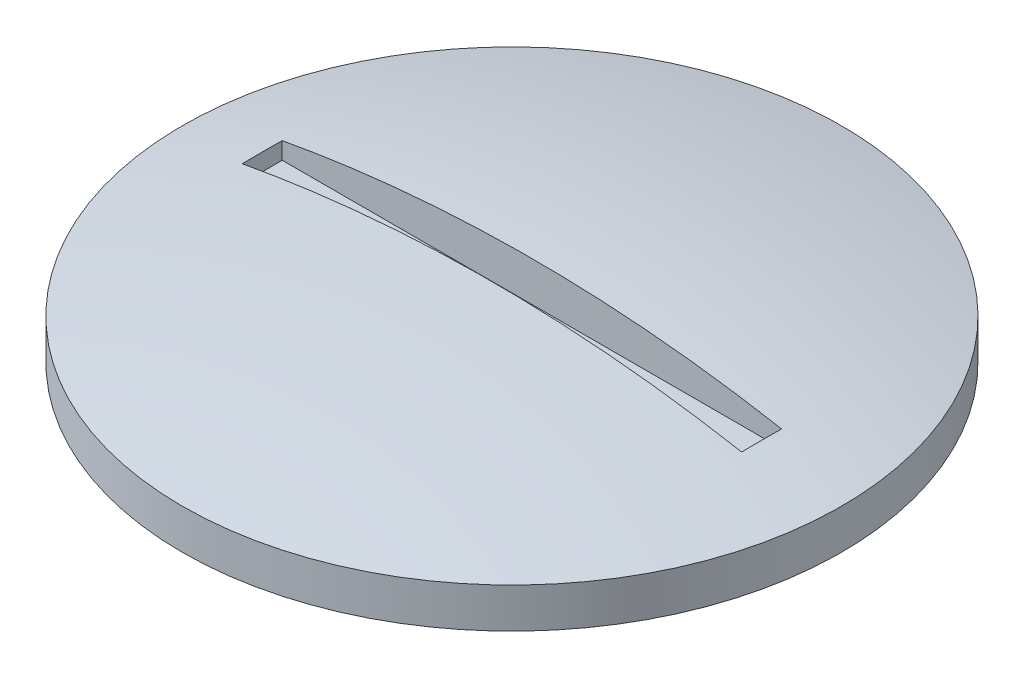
ISO-10303-21;
HEADER;
FILE_DESCRIPTION(('STEP AP214'),'2;1');
FILE_NAME('part.step','',(''),(''),'','','');
FILE_SCHEMA(('AUTOMOTIVE_DESIGN { 1 0 10303 214 1 1 1 1 }'));
ENDSEC;
DATA;
#1=APPLICATION_CONTEXT('core data for automotive mechanical design processes');
#2=APPLICATION_PROTOCOL_DEFINITION('international standard','automotive_design',2000,#1);
#3=PRODUCT_CONTEXT('',#1,'mechanical');
#4=PRODUCT('Part','Part','',(#3));
#5=PRODUCT_RELATED_PRODUCT_CATEGORY('part','',(#4));
#6=PRODUCT_DEFINITION_FORMATION('','',#4);
#7=PRODUCT_DEFINITION_CONTEXT('part definition',#1,'design');
#8=PRODUCT_DEFINITION('design','',#6,#7);
#9=PRODUCT_DEFINITION_SHAPE('','',#8);
#10=(LENGTH_UNIT() NAMED_UNIT(*) SI_UNIT(.MILLI.,.METRE.));
#11=(NAMED_UNIT(*) PLANE_ANGLE_UNIT() SI_UNIT($,.RADIAN.));
#12=(NAMED_UNIT(*) SI_UNIT($,.STERADIAN.) SOLID_ANGLE_UNIT());
#13=UNCERTAINTY_MEASURE_WITH_UNIT(LENGTH_MEASURE(1.E-05),#10,'distance_accuracy_value','');
#14=(GEOMETRIC_REPRESENTATION_CONTEXT(3) GLOBAL_UNCERTAINTY_ASSIGNED_CONTEXT((#13)) GLOBAL_UNIT_ASSIGNED_CONTEXT((#10,
#11,#12)) REPRESENTATION_CONTEXT('',''));
#15=CARTESIAN_POINT('',(0.,0.,0.));
#16=DIRECTION('',(0.,0.,1.));
#17=DIRECTION('',(1.,0.,0.));
#18=AXIS2_PLACEMENT_3D('',#15,#16,#17);
#19=CARTESIAN_POINT('',(420.25,32.,123.));
#20=DIRECTION('',(0.,-1.,0.));
#21=DIRECTION('',(0.,0.,-1.));
#22=AXIS2_PLACEMENT_3D('',#19,#20,#21);
#23=PLANE('',#22);
#24=CARTESIAN_POINT('',(412.,32.,123.));
#25=DIRECTION('',(0.,1.,0.));
#26=DIRECTION('',(0.,0.,1.));
#27=AXIS2_PLACEMENT_3D('',#24,#25,#26);
#28=CIRCLE('',#27,16.5);
#29=CARTESIAN_POINT('',(412.,32.,139.5));
#30=VERTEX_POINT('',#29);
#31=EDGE_CURVE('E67',#30,#30,#28,.T.);
#32=ORIENTED_EDGE('',*,*,#31,.F.);
#33=EDGE_LOOP('',(#32));
#34=FACE_BOUND('',#33,.T.);
#35=ADVANCED_FACE('F16',(#34),#23,.T.);
#36=CARTESIAN_POINT('',(412.,32.,123.));
#37=DIRECTION('',(0.,1.,0.));
#38=DIRECTION('',(0.,0.,1.));
#39=AXIS2_PLACEMENT_3D('',#36,#37,#38);
#40=CYLINDRICAL_SURFACE('',#39,16.5);
#41=ORIENTED_EDGE('',*,*,#31,.T.);
#42=EDGE_LOOP('',(#41));
#43=FACE_BOUND('',#42,.T.);
#44=CARTESIAN_POINT('',(412.,33.9999999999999,123.));
#45=DIRECTION('',(0.,1.,0.));
#46=DIRECTION('',(0.,0.,1.));
#47=AXIS2_PLACEMENT_3D('',#44,#45,#46);
#48=CIRCLE('',#47,16.5);
#49=CARTESIAN_POINT('',(412.,33.9999999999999,139.5));
#50=VERTEX_POINT('',#49);
#51=EDGE_CURVE('E66',#50,#50,#48,.T.);
#52=ORIENTED_EDGE('',*,*,#51,.F.);
#53=EDGE_LOOP('',(#52));
#54=FACE_BOUND('',#53,.T.);
#55=ADVANCED_FACE('F137',(#43,#54),#40,.T.);
#56=CARTESIAN_POINT('',(412.,36.,124.));
#57=DIRECTION('',(0.,0.,-1.));
#58=DIRECTION('',(-1.,0.,0.));
#59=AXIS2_PLACEMENT_3D('',#56,#57,#58);
#60=PLANE('',#59);
#61=DIRECTION('',(1.,0.,0.));
#62=VECTOR('',#61,1.);
#63=CARTESIAN_POINT('',(412.,34.,124.));
#64=LINE('',#63,#62);
#65=CARTESIAN_POINT('',(399.5,34.,124.));
#66=VERTEX_POINT('',#65);
#67=CARTESIAN_POINT('',(424.5,34.,124.));
#68=VERTEX_POINT('',#67);
#69=EDGE_CURVE('E75',#66,#68,#64,.T.);
#70=ORIENTED_EDGE('',*,*,#69,.F.);
#71=DIRECTION('',(0.,1.,0.));
#72=VECTOR('',#71,1.);
#73=CARTESIAN_POINT('',(399.5,36.,124.));
#74=LINE('',#73,#72);
#75=CARTESIAN_POINT('',(399.5,34.8519970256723,124.));
#76=VERTEX_POINT('',#75);
#77=EDGE_CURVE('E63',#76,#66,#74,.F.);
#78=ORIENTED_EDGE('',*,*,#77,.F.);
#79=CARTESIAN_POINT('',(424.5,34.8519970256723,124.));
#80=CARTESIAN_POINT('',(423.807458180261,34.979466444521,124.));
#81=CARTESIAN_POINT('',(423.112965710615,35.0963357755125,124.));
#82=CARTESIAN_POINT('',(421.72391657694,35.3082946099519,124.));
#83=CARTESIAN_POINT('',(421.029374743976,35.4034813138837,124.));
#84=CARTESIAN_POINT('',(419.64025550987,35.5723540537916,124.));
#85=CARTESIAN_POINT('',(418.945687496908,35.6461173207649,124.));
#86=CARTESIAN_POINT('',(417.556538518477,35.7723666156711,124.));
#87=CARTESIAN_POINT('',(416.861962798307,35.8249103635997,124.));
#88=CARTESIAN_POINT('',(415.472814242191,35.9088837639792,124.));
#89=CARTESIAN_POINT('',(414.778243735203,35.940351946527,124.));
#90=CARTESIAN_POINT('',(413.389115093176,35.9822802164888,124.));
#91=CARTESIAN_POINT('',(412.694557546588,35.9927598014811,124.));
#92=CARTESIAN_POINT('',(411.305442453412,35.9927598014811,124.));
#93=CARTESIAN_POINT('',(410.610884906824,35.9822802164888,124.));
#94=CARTESIAN_POINT('',(409.221756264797,35.940351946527,124.));
#95=CARTESIAN_POINT('',(408.527185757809,35.9088837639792,124.));
#96=CARTESIAN_POINT('',(407.138037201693,35.8249103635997,124.));
#97=CARTESIAN_POINT('',(406.443461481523,35.7723666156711,124.));
#98=CARTESIAN_POINT('',(405.054312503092,35.6461173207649,124.));
#99=CARTESIAN_POINT('',(404.35974449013,35.5723540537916,124.));
#100=CARTESIAN_POINT('',(402.970625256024,35.4034813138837,124.));
#101=CARTESIAN_POINT('',(402.27608342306,35.3082946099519,124.));
#102=CARTESIAN_POINT('',(400.887034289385,35.0963357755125,124.));
#103=CARTESIAN_POINT('',(400.192541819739,34.979466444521,124.));
#104=CARTESIAN_POINT('',(399.5,34.8519970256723,124.));
#105=B_SPLINE_CURVE_WITH_KNOTS('',3,(#79,#80,#81,#82,#83,#84,#85,#86,#87,#88,#89,#90,#91,#92,
#93,#94,#95,#96,#97,#98,#99,#100,#101,#102,#103,#104),.UNSPECIFIED.,.F.,.F.,(4,2,2,2,2,2,2,2,2,
2,2,2,4),(0.,2.11244228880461,4.21521975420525,6.31031989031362,8.39968204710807,
10.4852139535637,12.5688075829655,14.6524012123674,16.7379331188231,18.8272952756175,
20.9223954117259,23.0251728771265,25.1376151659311),.UNSPECIFIED.);
#106=CARTESIAN_POINT('',(424.5,34.8519970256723,124.));
#107=VERTEX_POINT('',#106);
#108=EDGE_CURVE('E57',#107,#76,#105,.T.);
#109=ORIENTED_EDGE('',*,*,#108,.F.);
#110=DIRECTION('',(0.,1.,0.));
#111=VECTOR('',#110,1.);
#112=CARTESIAN_POINT('',(424.5,36.,124.));
#113=LINE('',#112,#111);
#114=EDGE_CURVE('E62',#68,#107,#113,.T.);
#115=ORIENTED_EDGE('',*,*,#114,.F.);
#116=EDGE_LOOP('',(#70,#78,#109,#115));
#117=FACE_BOUND('',#116,.T.);
#118=ADVANCED_FACE('F60',(#117),#60,.T.);
#119=CARTESIAN_POINT('',(412.,-33.0625000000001,123.));
#120=DIRECTION('',(1.,0.,0.));
#121=DIRECTION('',(0.,1.,0.));
#122=AXIS2_PLACEMENT_3D('',#119,#120,#121);
#123=SPHERICAL_SURFACE('',#122,69.0625000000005);
#124=ORIENTED_EDGE('',*,*,#51,.T.);
#125=EDGE_LOOP('',(#124));
#126=FACE_BOUND('',#125,.T.);
#127=CARTESIAN_POINT('',(424.5,34.8519970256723,122.));
#128=CARTESIAN_POINT('',(423.807458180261,34.979466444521,122.));
#129=CARTESIAN_POINT('',(423.112965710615,35.0963357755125,122.));
#130=CARTESIAN_POINT('',(421.72391657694,35.3082946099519,122.));
#131=CARTESIAN_POINT('',(421.029374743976,35.4034813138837,122.));
#132=CARTESIAN_POINT('',(419.64025550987,35.5723540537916,122.));
#133=CARTESIAN_POINT('',(418.945687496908,35.646117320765,122.));
#134=CARTESIAN_POINT('',(417.556538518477,35.7723666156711,122.));
#135=CARTESIAN_POINT('',(416.861962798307,35.8249103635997,122.));
#136=CARTESIAN_POINT('',(415.472814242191,35.9088837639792,122.));
#137=CARTESIAN_POINT('',(414.778243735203,35.940351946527,122.));
#138=CARTESIAN_POINT('',(413.389115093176,35.9822802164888,122.));
#139=CARTESIAN_POINT('',(412.694557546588,35.9927598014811,122.));
#140=CARTESIAN_POINT('',(411.305442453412,35.9927598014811,122.));
#141=CARTESIAN_POINT('',(410.610884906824,35.9822802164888,122.));
#142=CARTESIAN_POINT('',(409.221756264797,35.940351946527,122.));
#143=CARTESIAN_POINT('',(408.527185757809,35.9088837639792,122.));
#144=CARTESIAN_POINT('',(407.138037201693,35.8249103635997,122.));
#145=CARTESIAN_POINT('',(406.443461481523,35.7723666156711,122.));
#146=CARTESIAN_POINT('',(405.054312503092,35.646117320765,122.));
#147=CARTESIAN_POINT('',(404.35974449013,35.5723540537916,122.));
#148=CARTESIAN_POINT('',(402.970625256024,35.4034813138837,122.));
#149=CARTESIAN_POINT('',(402.27608342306,35.3082946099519,122.));
#150=CARTESIAN_POINT('',(400.887034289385,35.0963357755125,122.));
#151=CARTESIAN_POINT('',(400.192541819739,34.979466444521,122.));
#152=CARTESIAN_POINT('',(399.5,34.8519970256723,122.));
#153=B_SPLINE_CURVE_WITH_KNOTS('',3,(#127,#128,#129,#130,#131,#132,#133,#134,#135,#136,#137,
#138,#139,#140,#141,#142,#143,#144,#145,#146,#147,#148,#149,#150,#151,#152),.UNSPECIFIED.,.F.,
.F.,(4,2,2,2,2,2,2,2,2,2,2,2,4),(0.,2.11244228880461,4.21521975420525,6.31031989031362,
8.39968204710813,10.4852139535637,12.5688075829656,14.6524012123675,16.7379331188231,
18.8272952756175,20.9223954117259,23.0251728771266,25.1376151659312),.UNSPECIFIED.);
#154=CARTESIAN_POINT('',(424.5,34.8519970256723,122.));
#155=VERTEX_POINT('',#154);
#156=CARTESIAN_POINT('',(399.5,34.8519970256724,122.));
#157=VERTEX_POINT('',#156);
#158=EDGE_CURVE('E73',#155,#157,#153,.T.);
#159=ORIENTED_EDGE('',*,*,#158,.F.);
#160=CARTESIAN_POINT('',(424.5,-33.0625000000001,123.));
#161=DIRECTION('',(1.,0.,0.));
#162=DIRECTION('',(0.,0.,-1.));
#163=AXIS2_PLACEMENT_3D('',#160,#161,#162);
#164=CIRCLE('',#163,67.9218588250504);
#165=EDGE_CURVE('E70',#107,#155,#164,.F.);
#166=ORIENTED_EDGE('',*,*,#165,.F.);
#167=ORIENTED_EDGE('',*,*,#108,.T.);
#168=CARTESIAN_POINT('',(399.5,-33.0625000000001,123.));
#169=DIRECTION('',(1.,0.,0.));
#170=DIRECTION('',(0.,0.,-1.));
#171=AXIS2_PLACEMENT_3D('',#168,#169,#170);
#172=CIRCLE('',#171,67.9218588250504);
#173=EDGE_CURVE('E124',#157,#76,#172,.T.);
#174=ORIENTED_EDGE('',*,*,#173,.F.);
#175=EDGE_LOOP('',(#159,#166,#167,#174));
#176=FACE_BOUND('',#175,.T.);
#177=ADVANCED_FACE('F71',(#126,#176),#123,.T.);
#178=CARTESIAN_POINT('',(399.5,36.,123.));
#179=DIRECTION('',(1.,0.,0.));
#180=DIRECTION('',(0.,0.,-1.));
#181=AXIS2_PLACEMENT_3D('',#178,#179,#180);
#182=PLANE('',#181);
#183=DIRECTION('',(0.,0.,1.));
#184=VECTOR('',#183,1.);
#185=CARTESIAN_POINT('',(399.5,34.,123.));
#186=LINE('',#185,#184);
#187=CARTESIAN_POINT('',(399.5,34.,122.));
#188=VERTEX_POINT('',#187);
#189=EDGE_CURVE('E100',#188,#66,#186,.T.);
#190=ORIENTED_EDGE('',*,*,#189,.F.);
#191=DIRECTION('',(0.,1.,0.));
#192=VECTOR('',#191,1.);
#193=CARTESIAN_POINT('',(399.5,36.,122.));
#194=LINE('',#193,#192);
#195=EDGE_CURVE('E79',#157,#188,#194,.F.);
#196=ORIENTED_EDGE('',*,*,#195,.F.);
#197=ORIENTED_EDGE('',*,*,#173,.T.);
#198=ORIENTED_EDGE('',*,*,#77,.T.);
#199=EDGE_LOOP('',(#190,#196,#197,#198));
#200=FACE_BOUND('',#199,.T.);
#201=ADVANCED_FACE('F117',(#200),#182,.T.);
#202=CARTESIAN_POINT('',(412.,34.,123.));
#203=DIRECTION('',(0.,1.,0.));
#204=DIRECTION('',(0.,0.,1.));
#205=AXIS2_PLACEMENT_3D('',#202,#203,#204);
#206=PLANE('',#205);
#207=ORIENTED_EDGE('',*,*,#189,.T.);
#208=ORIENTED_EDGE('',*,*,#69,.T.);
#209=DIRECTION('',(0.,0.,1.));
#210=VECTOR('',#209,1.);
#211=CARTESIAN_POINT('',(424.5,34.,123.));
#212=LINE('',#211,#210);
#213=CARTESIAN_POINT('',(424.5,34.,122.));
#214=VERTEX_POINT('',#213);
#215=EDGE_CURVE('E36',#214,#68,#212,.T.);
#216=ORIENTED_EDGE('',*,*,#215,.F.);
#217=DIRECTION('',(1.,0.,0.));
#218=VECTOR('',#217,1.);
#219=CARTESIAN_POINT('',(412.,34.,122.));
#220=LINE('',#219,#218);
#221=EDGE_CURVE('E27',#188,#214,#220,.T.);
#222=ORIENTED_EDGE('',*,*,#221,.F.);
#223=EDGE_LOOP('',(#207,#208,#216,#222));
#224=FACE_BOUND('',#223,.T.);
#225=ADVANCED_FACE('F151',(#224),#206,.T.);
#226=CARTESIAN_POINT('',(424.5,36.,123.));
#227=DIRECTION('',(-1.,0.,0.));
#228=DIRECTION('',(0.,0.,1.));
#229=AXIS2_PLACEMENT_3D('',#226,#227,#228);
#230=PLANE('',#229);
#231=ORIENTED_EDGE('',*,*,#215,.T.);
#232=ORIENTED_EDGE('',*,*,#114,.T.);
#233=ORIENTED_EDGE('',*,*,#165,.T.);
#234=DIRECTION('',(0.,1.,0.));
#235=VECTOR('',#234,1.);
#236=CARTESIAN_POINT('',(424.5,36.,122.));
#237=LINE('',#236,#235);
#238=EDGE_CURVE('E11',#214,#155,#237,.T.);
#239=ORIENTED_EDGE('',*,*,#238,.F.);
#240=EDGE_LOOP('',(#231,#232,#233,#239));
#241=FACE_BOUND('',#240,.T.);
#242=ADVANCED_FACE('F77',(#241),#230,.T.);
#243=CARTESIAN_POINT('',(412.,36.,122.));
#244=DIRECTION('',(0.,0.,1.));
#245=DIRECTION('',(1.,0.,0.));
#246=AXIS2_PLACEMENT_3D('',#243,#244,#245);
#247=PLANE('',#246);
#248=ORIENTED_EDGE('',*,*,#221,.T.);
#249=ORIENTED_EDGE('',*,*,#238,.T.);
#250=ORIENTED_EDGE('',*,*,#158,.T.);
#251=ORIENTED_EDGE('',*,*,#195,.T.);
#252=EDGE_LOOP('',(#248,#249,#250,#251));
#253=FACE_BOUND('',#252,.T.);
#254=ADVANCED_FACE('F18',(#253),#247,.T.);
#255=CLOSED_SHELL('',(#35,#55,#118,#177,#201,#225,#242,#254));
#256=MANIFOLD_SOLID_BREP('B1',#255);
#257=ADVANCED_BREP_SHAPE_REPRESENTATION('',(#18,#256),#14);
#258=SHAPE_DEFINITION_REPRESENTATION(#9,#257);
ENDSEC;
END-ISO-10303-21;
